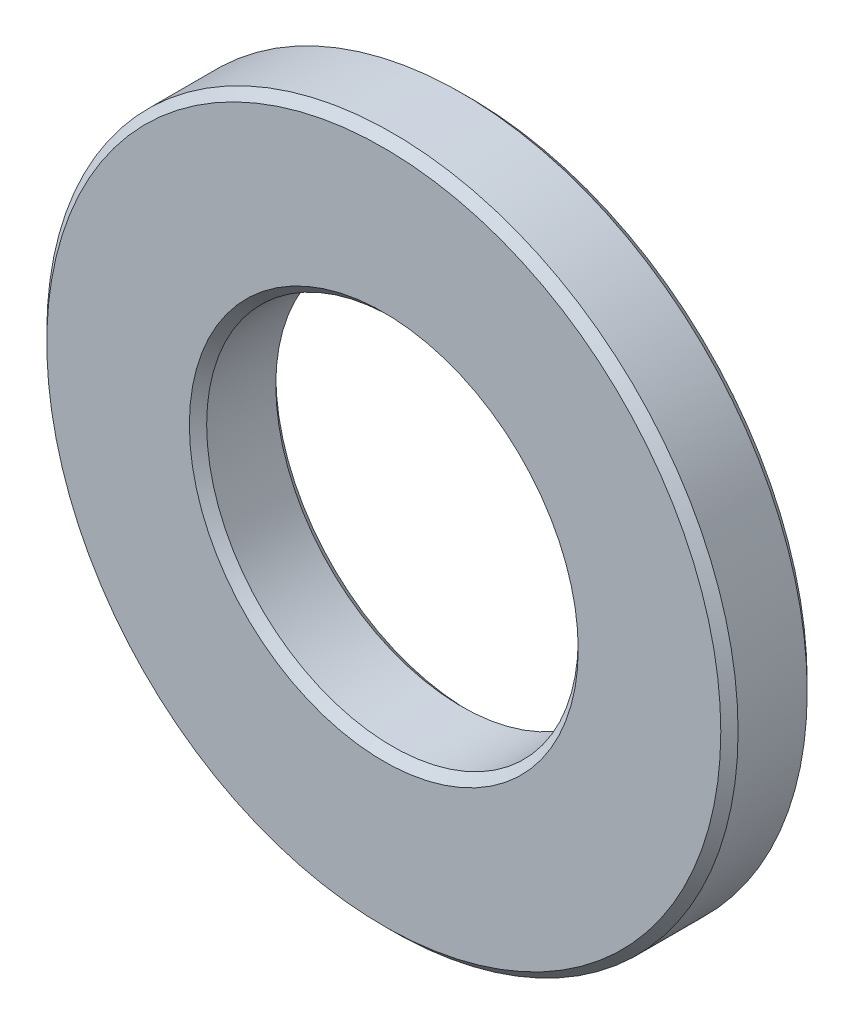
ISO-10303-21;
HEADER;
FILE_DESCRIPTION(('STEP AP214'),'2;1');
FILE_NAME('part.step','',(''),(''),'','','');
FILE_SCHEMA(('AUTOMOTIVE_DESIGN { 1 0 10303 214 1 1 1 1 }'));
ENDSEC;
DATA;
#1=APPLICATION_CONTEXT('core data for automotive mechanical design processes');
#2=APPLICATION_PROTOCOL_DEFINITION('international standard','automotive_design',2000,#1);
#3=PRODUCT_CONTEXT('',#1,'mechanical');
#4=PRODUCT('Part','Part','',(#3));
#5=PRODUCT_RELATED_PRODUCT_CATEGORY('part','',(#4));
#6=PRODUCT_DEFINITION_FORMATION('','',#4);
#7=PRODUCT_DEFINITION_CONTEXT('part definition',#1,'design');
#8=PRODUCT_DEFINITION('design','',#6,#7);
#9=PRODUCT_DEFINITION_SHAPE('','',#8);
#10=(LENGTH_UNIT() NAMED_UNIT(*) SI_UNIT(.MILLI.,.METRE.));
#11=(NAMED_UNIT(*) PLANE_ANGLE_UNIT() SI_UNIT($,.RADIAN.));
#12=(NAMED_UNIT(*) SI_UNIT($,.STERADIAN.) SOLID_ANGLE_UNIT());
#13=UNCERTAINTY_MEASURE_WITH_UNIT(LENGTH_MEASURE(1.E-05),#10,'distance_accuracy_value','');
#14=(GEOMETRIC_REPRESENTATION_CONTEXT(3) GLOBAL_UNCERTAINTY_ASSIGNED_CONTEXT((#13)) GLOBAL_UNIT_ASSIGNED_CONTEXT((#10,
#11,#12)) REPRESENTATION_CONTEXT('',''));
#15=CARTESIAN_POINT('',(0.,0.,0.));
#16=DIRECTION('',(0.,0.,1.));
#17=DIRECTION('',(1.,0.,0.));
#18=AXIS2_PLACEMENT_3D('',#15,#16,#17);
#19=CARTESIAN_POINT('',(0.,0.,0.5));
#20=DIRECTION('',(0.,0.,1.));
#21=DIRECTION('',(1.,0.,0.));
#22=AXIS2_PLACEMENT_3D('',#19,#20,#21);
#23=PLANE('',#22);
#24=CARTESIAN_POINT('',(0.,0.,0.5));
#25=DIRECTION('',(0.,0.,1.));
#26=DIRECTION('',(1.,0.,0.));
#27=AXIS2_PLACEMENT_3D('',#24,#25,#26);
#28=CIRCLE('',#27,2.25);
#29=CARTESIAN_POINT('',(2.25,0.,0.5));
#30=VERTEX_POINT('',#29);
#31=EDGE_CURVE('E10',#30,#30,#28,.F.);
#32=ORIENTED_EDGE('',*,*,#31,.T.);
#33=EDGE_LOOP('',(#32));
#34=FACE_BOUND('',#33,.T.);
#35=CARTESIAN_POINT('',(0.,0.,0.5));
#36=DIRECTION('',(0.,0.,1.));
#37=DIRECTION('',(1.,0.,0.));
#38=AXIS2_PLACEMENT_3D('',#35,#36,#37);
#39=CIRCLE('',#38,3.9);
#40=CARTESIAN_POINT('',(3.9,0.,0.5));
#41=VERTEX_POINT('',#40);
#42=EDGE_CURVE('E45',#41,#41,#39,.T.);
#43=ORIENTED_EDGE('',*,*,#42,.T.);
#44=EDGE_LOOP('',(#43));
#45=FACE_BOUND('',#44,.T.);
#46=ADVANCED_FACE('F37',(#34,#45),#23,.T.);
#47=CARTESIAN_POINT('',(0.,0.,-0.5));
#48=DIRECTION('',(0.,0.,1.));
#49=DIRECTION('',(1.,0.,0.));
#50=AXIS2_PLACEMENT_3D('',#47,#48,#49);
#51=PLANE('',#50);
#52=CARTESIAN_POINT('',(0.,0.,-0.5));
#53=DIRECTION('',(0.,0.,1.));
#54=DIRECTION('',(1.,0.,0.));
#55=AXIS2_PLACEMENT_3D('',#52,#53,#54);
#56=CIRCLE('',#55,3.9);
#57=CARTESIAN_POINT('',(3.9,0.,-0.5));
#58=VERTEX_POINT('',#57);
#59=EDGE_CURVE('E63',#58,#58,#56,.F.);
#60=ORIENTED_EDGE('',*,*,#59,.T.);
#61=EDGE_LOOP('',(#60));
#62=FACE_BOUND('',#61,.T.);
#63=CARTESIAN_POINT('',(0.,0.,-0.5));
#64=DIRECTION('',(0.,0.,1.));
#65=DIRECTION('',(1.,0.,0.));
#66=AXIS2_PLACEMENT_3D('',#63,#64,#65);
#67=CIRCLE('',#66,2.25);
#68=CARTESIAN_POINT('',(-2.25,0.,-0.5));
#69=VERTEX_POINT('',#68);
#70=EDGE_CURVE('E67',#69,#69,#67,.T.);
#71=ORIENTED_EDGE('',*,*,#70,.T.);
#72=EDGE_LOOP('',(#71));
#73=FACE_BOUND('',#72,.T.);
#74=ADVANCED_FACE('F89',(#62,#73),#51,.F.);
#75=CARTESIAN_POINT('',(0.,0.,0.5));
#76=DIRECTION('',(0.,0.,-1.));
#77=DIRECTION('',(-1.,0.,0.));
#78=AXIS2_PLACEMENT_3D('',#75,#76,#77);
#79=CYLINDRICAL_SURFACE('',#78,4.);
#80=CARTESIAN_POINT('',(0.,0.,-0.400000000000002));
#81=DIRECTION('',(0.,0.,1.));
#82=DIRECTION('',(1.,0.,0.));
#83=AXIS2_PLACEMENT_3D('',#80,#81,#82);
#84=CIRCLE('',#83,4.);
#85=CARTESIAN_POINT('',(4.,0.,-0.400000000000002));
#86=VERTEX_POINT('',#85);
#87=EDGE_CURVE('E71',#86,#86,#84,.T.);
#88=ORIENTED_EDGE('',*,*,#87,.T.);
#89=EDGE_LOOP('',(#88));
#90=FACE_BOUND('',#89,.T.);
#91=CARTESIAN_POINT('',(0.,0.,0.400000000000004));
#92=DIRECTION('',(0.,0.,1.));
#93=DIRECTION('',(1.,0.,0.));
#94=AXIS2_PLACEMENT_3D('',#91,#92,#93);
#95=CIRCLE('',#94,4.);
#96=CARTESIAN_POINT('',(4.,0.,0.400000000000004));
#97=VERTEX_POINT('',#96);
#98=EDGE_CURVE('E74',#97,#97,#95,.F.);
#99=ORIENTED_EDGE('',*,*,#98,.T.);
#100=EDGE_LOOP('',(#99));
#101=FACE_BOUND('',#100,.T.);
#102=ADVANCED_FACE('F78',(#90,#101),#79,.T.);
#103=CARTESIAN_POINT('',(0.,0.,0.5));
#104=DIRECTION('',(0.,0.,-1.));
#105=DIRECTION('',(-1.,0.,0.));
#106=AXIS2_PLACEMENT_3D('',#103,#104,#105);
#107=CYLINDRICAL_SURFACE('',#106,2.15);
#108=CARTESIAN_POINT('',(0.,0.,-0.4));
#109=DIRECTION('',(0.,0.,1.));
#110=DIRECTION('',(1.,0.,0.));
#111=AXIS2_PLACEMENT_3D('',#108,#109,#110);
#112=CIRCLE('',#111,2.15);
#113=CARTESIAN_POINT('',(-2.15,0.,-0.4));
#114=VERTEX_POINT('',#113);
#115=EDGE_CURVE('E52',#114,#114,#112,.F.);
#116=CARTESIAN_POINT('',(0.,0.,0.400000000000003));
#117=DIRECTION('',(0.,0.,1.));
#118=DIRECTION('',(1.,0.,0.));
#119=AXIS2_PLACEMENT_3D('',#116,#117,#118);
#120=CIRCLE('',#119,2.15);
#121=CARTESIAN_POINT('',(-2.15,0.,0.400000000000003));
#122=VERTEX_POINT('',#121);
#123=EDGE_CURVE('E57',#122,#122,#120,.T.);
#124=CARTESIAN_POINT('',(-2.15,0.,-0.4));
#125=CARTESIAN_POINT('',(-2.15,0.,-0.391666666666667));
#126=CARTESIAN_POINT('',(-2.15,0.,-0.383333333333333));
#127=CARTESIAN_POINT('',(-2.15,0.,-0.366666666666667));
#128=CARTESIAN_POINT('',(-2.15,0.,-0.358333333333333));
#129=CARTESIAN_POINT('',(-2.15,0.,-0.341666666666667));
#130=CARTESIAN_POINT('',(-2.15,0.,-0.333333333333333));
#131=CARTESIAN_POINT('',(-2.15,0.,-0.316666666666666));
#132=CARTESIAN_POINT('',(-2.15,0.,-0.308333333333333));
#133=CARTESIAN_POINT('',(-2.15,0.,-0.291666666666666));
#134=CARTESIAN_POINT('',(-2.15,0.,-0.283333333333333));
#135=CARTESIAN_POINT('',(-2.15,0.,-0.266666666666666));
#136=CARTESIAN_POINT('',(-2.15,0.,-0.258333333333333));
#137=CARTESIAN_POINT('',(-2.15,0.,-0.241666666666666));
#138=CARTESIAN_POINT('',(-2.15,0.,-0.233333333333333));
#139=CARTESIAN_POINT('',(-2.15,0.,-0.216666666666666));
#140=CARTESIAN_POINT('',(-2.15,0.,-0.208333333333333));
#141=CARTESIAN_POINT('',(-2.15,0.,-0.191666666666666));
#142=CARTESIAN_POINT('',(-2.15,0.,-0.183333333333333));
#143=CARTESIAN_POINT('',(-2.15,0.,-0.166666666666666));
#144=CARTESIAN_POINT('',(-2.15,0.,-0.158333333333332));
#145=CARTESIAN_POINT('',(-2.15,0.,-0.141666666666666));
#146=CARTESIAN_POINT('',(-2.15,0.,-0.133333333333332));
#147=CARTESIAN_POINT('',(-2.15,0.,-0.116666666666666));
#148=CARTESIAN_POINT('',(-2.15,0.,-0.108333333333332));
#149=CARTESIAN_POINT('',(-2.15,0.,-0.0916666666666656));
#150=CARTESIAN_POINT('',(-2.15,0.,-0.0833333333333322));
#151=CARTESIAN_POINT('',(-2.15,0.,-0.0666666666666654));
#152=CARTESIAN_POINT('',(-2.15,0.,-0.0583333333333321));
#153=CARTESIAN_POINT('',(-2.15,0.,-0.0416666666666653));
#154=CARTESIAN_POINT('',(-2.15,0.,-0.0333333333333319));
#155=CARTESIAN_POINT('',(-2.15,0.,-0.0166666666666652));
#156=CARTESIAN_POINT('',(-2.15,0.,-0.00833333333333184));
#157=CARTESIAN_POINT('',(-2.15,0.,0.00833333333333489));
#158=CARTESIAN_POINT('',(-2.15,0.,0.0166666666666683));
#159=CARTESIAN_POINT('',(-2.15,0.,0.033333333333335));
#160=CARTESIAN_POINT('',(-2.15,0.,0.0416666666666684));
#161=CARTESIAN_POINT('',(-2.15,0.,0.0583333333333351));
#162=CARTESIAN_POINT('',(-2.15,0.,0.0666666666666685));
#163=CARTESIAN_POINT('',(-2.15,0.,0.0833333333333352));
#164=CARTESIAN_POINT('',(-2.15,0.,0.0916666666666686));
#165=CARTESIAN_POINT('',(-2.15,0.,0.108333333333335));
#166=CARTESIAN_POINT('',(-2.15,0.,0.116666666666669));
#167=CARTESIAN_POINT('',(-2.15,0.,0.133333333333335));
#168=CARTESIAN_POINT('',(-2.15,0.,0.141666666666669));
#169=CARTESIAN_POINT('',(-2.15,0.,0.158333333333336));
#170=CARTESIAN_POINT('',(-2.15,0.,0.166666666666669));
#171=CARTESIAN_POINT('',(-2.15,0.,0.183333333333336));
#172=CARTESIAN_POINT('',(-2.15,0.,0.191666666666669));
#173=CARTESIAN_POINT('',(-2.15,0.,0.208333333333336));
#174=CARTESIAN_POINT('',(-2.15,0.,0.216666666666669));
#175=CARTESIAN_POINT('',(-2.15,0.,0.233333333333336));
#176=CARTESIAN_POINT('',(-2.15,0.,0.241666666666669));
#177=CARTESIAN_POINT('',(-2.15,0.,0.258333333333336));
#178=CARTESIAN_POINT('',(-2.15,0.,0.266666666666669));
#179=CARTESIAN_POINT('',(-2.15,0.,0.283333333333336));
#180=CARTESIAN_POINT('',(-2.15,0.,0.291666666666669));
#181=CARTESIAN_POINT('',(-2.15,0.,0.308333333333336));
#182=CARTESIAN_POINT('',(-2.15,0.,0.31666666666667));
#183=CARTESIAN_POINT('',(-2.15,0.,0.333333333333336));
#184=CARTESIAN_POINT('',(-2.15,0.,0.34166666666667));
#185=CARTESIAN_POINT('',(-2.15,0.,0.358333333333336));
#186=CARTESIAN_POINT('',(-2.15,0.,0.36666666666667));
#187=CARTESIAN_POINT('',(-2.15,0.,0.383333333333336));
#188=CARTESIAN_POINT('',(-2.15,0.,0.39166666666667));
#189=CARTESIAN_POINT('',(-2.15,0.,0.400000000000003));
#190=B_SPLINE_CURVE_WITH_KNOTS('',3,(#124,#125,#126,#127,#128,#129,#130,#131,#132,#133,#134,
#135,#136,#137,#138,#139,#140,#141,#142,#143,#144,#145,#146,#147,#148,#149,#150,#151,#152,#153,
#154,#155,#156,#157,#158,#159,#160,#161,#162,#163,#164,#165,#166,#167,#168,#169,#170,#171,#172,
#173,#174,#175,#176,#177,#178,#179,#180,#181,#182,#183,#184,#185,#186,#187,#188,#189),
.UNSPECIFIED.,.F.,.F.,(4,2,2,2,2,2,2,2,2,2,2,2,2,2,2,2,2,2,2,2,2,2,2,2,2,2,2,2,2,2,2,2,4),(0.,
0.0250000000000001,0.0500000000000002,0.0750000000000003,0.1,0.125000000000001,
0.150000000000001,0.175000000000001,0.200000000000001,0.225000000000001,0.250000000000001,
0.275000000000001,0.300000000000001,0.325000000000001,0.350000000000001,0.375000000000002,
0.400000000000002,0.425000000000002,0.450000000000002,0.475000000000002,0.500000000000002,
0.525000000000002,0.550000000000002,0.575000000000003,0.600000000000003,0.625000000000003,
0.650000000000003,0.675000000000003,0.700000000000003,0.725000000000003,0.750000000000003,
0.775000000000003,0.800000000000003),.UNSPECIFIED.);
#191=EDGE_CURVE('BSEAM97',#114,#122,#190,.T.);
#192=ORIENTED_EDGE('',*,*,#115,.T.);
#193=ORIENTED_EDGE('',*,*,#123,.T.);
#194=ORIENTED_EDGE('',*,*,#191,.T.);
#195=ORIENTED_EDGE('',*,*,#191,.F.);
#196=EDGE_LOOP('',(#192,#194,#193,#195));
#197=FACE_BOUND('',#196,.T.);
#198=ADVANCED_FACE('F97',(#197),#107,.F.);
#199=CARTESIAN_POINT('',(0.,0.,-0.400000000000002));
#200=DIRECTION('',(0.,0.,1.));
#201=DIRECTION('',(1.,0.,0.));
#202=AXIS2_PLACEMENT_3D('',#199,#200,#201);
#203=CONICAL_SURFACE('',#202,4.,0.785398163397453);
#204=ORIENTED_EDGE('',*,*,#59,.F.);
#205=EDGE_LOOP('',(#204));
#206=FACE_BOUND('',#205,.T.);
#207=ORIENTED_EDGE('',*,*,#87,.F.);
#208=EDGE_LOOP('',(#207));
#209=FACE_BOUND('',#208,.T.);
#210=ADVANCED_FACE('F102',(#206,#209),#203,.T.);
#211=CARTESIAN_POINT('',(0.,0.,-0.5));
#212=DIRECTION('',(0.,0.,-1.));
#213=DIRECTION('',(-1.,0.,0.));
#214=AXIS2_PLACEMENT_3D('',#211,#212,#213);
#215=CONICAL_SURFACE('',#214,2.25,0.785398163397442);
#216=CARTESIAN_POINT('',(-2.15,0.,-0.4));
#217=CARTESIAN_POINT('',(-2.15104166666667,0.,-0.401041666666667));
#218=CARTESIAN_POINT('',(-2.15208333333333,0.,-0.402083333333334));
#219=CARTESIAN_POINT('',(-2.15416666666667,0.,-0.404166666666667));
#220=CARTESIAN_POINT('',(-2.15520833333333,0.,-0.405208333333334));
#221=CARTESIAN_POINT('',(-2.15729166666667,0.,-0.407291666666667));
#222=CARTESIAN_POINT('',(-2.15833333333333,0.,-0.408333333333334));
#223=CARTESIAN_POINT('',(-2.16041666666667,0.,-0.410416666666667));
#224=CARTESIAN_POINT('',(-2.16145833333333,0.,-0.411458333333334));
#225=CARTESIAN_POINT('',(-2.16354166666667,0.,-0.413541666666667));
#226=CARTESIAN_POINT('',(-2.16458333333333,0.,-0.414583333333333));
#227=CARTESIAN_POINT('',(-2.16666666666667,0.,-0.416666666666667));
#228=CARTESIAN_POINT('',(-2.16770833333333,0.,-0.417708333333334));
#229=CARTESIAN_POINT('',(-2.16979166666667,0.,-0.419791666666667));
#230=CARTESIAN_POINT('',(-2.17083333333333,0.,-0.420833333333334));
#231=CARTESIAN_POINT('',(-2.17291666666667,0.,-0.422916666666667));
#232=CARTESIAN_POINT('',(-2.17395833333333,0.,-0.423958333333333));
#233=CARTESIAN_POINT('',(-2.17604166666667,0.,-0.426041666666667));
#234=CARTESIAN_POINT('',(-2.17708333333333,0.,-0.427083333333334));
#235=CARTESIAN_POINT('',(-2.17916666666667,0.,-0.429166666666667));
#236=CARTESIAN_POINT('',(-2.18020833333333,0.,-0.430208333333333));
#237=CARTESIAN_POINT('',(-2.18229166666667,0.,-0.432291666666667));
#238=CARTESIAN_POINT('',(-2.18333333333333,0.,-0.433333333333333));
#239=CARTESIAN_POINT('',(-2.18541666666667,0.,-0.435416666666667));
#240=CARTESIAN_POINT('',(-2.18645833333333,0.,-0.436458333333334));
#241=CARTESIAN_POINT('',(-2.18854166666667,0.,-0.438541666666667));
#242=CARTESIAN_POINT('',(-2.18958333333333,0.,-0.439583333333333));
#243=CARTESIAN_POINT('',(-2.19166666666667,0.,-0.441666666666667));
#244=CARTESIAN_POINT('',(-2.19270833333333,0.,-0.442708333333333));
#245=CARTESIAN_POINT('',(-2.19479166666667,0.,-0.444791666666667));
#246=CARTESIAN_POINT('',(-2.19583333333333,0.,-0.445833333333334));
#247=CARTESIAN_POINT('',(-2.19791666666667,0.,-0.447916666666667));
#248=CARTESIAN_POINT('',(-2.19895833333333,0.,-0.448958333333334));
#249=CARTESIAN_POINT('',(-2.20104166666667,0.,-0.451041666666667));
#250=CARTESIAN_POINT('',(-2.20208333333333,0.,-0.452083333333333));
#251=CARTESIAN_POINT('',(-2.20416666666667,0.,-0.454166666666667));
#252=CARTESIAN_POINT('',(-2.20520833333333,0.,-0.455208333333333));
#253=CARTESIAN_POINT('',(-2.20729166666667,0.,-0.457291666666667));
#254=CARTESIAN_POINT('',(-2.20833333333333,0.,-0.458333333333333));
#255=CARTESIAN_POINT('',(-2.21041666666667,0.,-0.460416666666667));
#256=CARTESIAN_POINT('',(-2.21145833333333,0.,-0.461458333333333));
#257=CARTESIAN_POINT('',(-2.21354166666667,0.,-0.463541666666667));
#258=CARTESIAN_POINT('',(-2.21458333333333,0.,-0.464583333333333));
#259=CARTESIAN_POINT('',(-2.21666666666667,0.,-0.466666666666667));
#260=CARTESIAN_POINT('',(-2.21770833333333,0.,-0.467708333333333));
#261=CARTESIAN_POINT('',(-2.21979166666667,0.,-0.469791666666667));
#262=CARTESIAN_POINT('',(-2.22083333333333,0.,-0.470833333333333));
#263=CARTESIAN_POINT('',(-2.22291666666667,0.,-0.472916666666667));
#264=CARTESIAN_POINT('',(-2.22395833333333,0.,-0.473958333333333));
#265=CARTESIAN_POINT('',(-2.22604166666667,0.,-0.476041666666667));
#266=CARTESIAN_POINT('',(-2.22708333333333,0.,-0.477083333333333));
#267=CARTESIAN_POINT('',(-2.22916666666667,0.,-0.479166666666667));
#268=CARTESIAN_POINT('',(-2.23020833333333,0.,-0.480208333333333));
#269=CARTESIAN_POINT('',(-2.23229166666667,0.,-0.482291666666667));
#270=CARTESIAN_POINT('',(-2.23333333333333,0.,-0.483333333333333));
#271=CARTESIAN_POINT('',(-2.23541666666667,0.,-0.485416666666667));
#272=CARTESIAN_POINT('',(-2.23645833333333,0.,-0.486458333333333));
#273=CARTESIAN_POINT('',(-2.23854166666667,0.,-0.488541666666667));
#274=CARTESIAN_POINT('',(-2.23958333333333,0.,-0.489583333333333));
#275=CARTESIAN_POINT('',(-2.24166666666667,0.,-0.491666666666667));
#276=CARTESIAN_POINT('',(-2.24270833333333,0.,-0.492708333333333));
#277=CARTESIAN_POINT('',(-2.24479166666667,0.,-0.494791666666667));
#278=CARTESIAN_POINT('',(-2.24583333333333,0.,-0.495833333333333));
#279=CARTESIAN_POINT('',(-2.24791666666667,0.,-0.497916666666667));
#280=CARTESIAN_POINT('',(-2.24895833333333,0.,-0.498958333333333));
#281=CARTESIAN_POINT('',(-2.25,0.,-0.5));
#282=B_SPLINE_CURVE_WITH_KNOTS('',3,(#216,#217,#218,#219,#220,#221,#222,#223,#224,#225,#226,
#227,#228,#229,#230,#231,#232,#233,#234,#235,#236,#237,#238,#239,#240,#241,#242,#243,#244,#245,
#246,#247,#248,#249,#250,#251,#252,#253,#254,#255,#256,#257,#258,#259,#260,#261,#262,#263,#264,
#265,#266,#267,#268,#269,#270,#271,#272,#273,#274,#275,#276,#277,#278,#279,#280,#281),
.UNSPECIFIED.,.F.,.F.,(4,2,2,2,2,2,2,2,2,2,2,2,2,2,2,2,2,2,2,2,2,2,2,2,2,2,2,2,2,2,2,2,4),(0.,
0.00441941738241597,0.00883883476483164,0.0132582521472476,0.0176776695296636,
0.0220970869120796,0.0265165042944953,0.0309359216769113,0.0353553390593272,0.0397747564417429,
0.0441941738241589,0.0486135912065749,0.0530330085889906,0.0574524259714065,0.0618718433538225,
0.0662912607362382,0.0707106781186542,0.0751300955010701,0.0795495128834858,0.0839689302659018,
0.0883883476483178,0.0928077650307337,0.0972271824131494,0.101646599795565,0.106066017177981,
0.110485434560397,0.114904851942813,0.119324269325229,0.123743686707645,0.128163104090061,
0.132582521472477,0.137001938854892,0.141421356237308),.UNSPECIFIED.);
#283=EDGE_CURVE('BSEAM86',#114,#69,#282,.T.);
#284=ORIENTED_EDGE('',*,*,#115,.F.);
#285=ORIENTED_EDGE('',*,*,#70,.F.);
#286=ORIENTED_EDGE('',*,*,#283,.T.);
#287=ORIENTED_EDGE('',*,*,#283,.F.);
#288=EDGE_LOOP('',(#284,#286,#285,#287));
#289=FACE_BOUND('',#288,.T.);
#290=ADVANCED_FACE('F86',(#289),#215,.F.);
#291=CARTESIAN_POINT('',(0.,0.,0.400000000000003));
#292=DIRECTION('',(0.,0.,1.));
#293=DIRECTION('',(1.,0.,0.));
#294=AXIS2_PLACEMENT_3D('',#291,#292,#293);
#295=CONICAL_SURFACE('',#294,2.15,0.785398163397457);
#296=ORIENTED_EDGE('',*,*,#31,.F.);
#297=EDGE_LOOP('',(#296));
#298=FACE_BOUND('',#297,.T.);
#299=ORIENTED_EDGE('',*,*,#123,.F.);
#300=EDGE_LOOP('',(#299));
#301=FACE_BOUND('',#300,.T.);
#302=ADVANCED_FACE('F82',(#298,#301),#295,.F.);
#303=CARTESIAN_POINT('',(0.,0.,0.5));
#304=DIRECTION('',(0.,0.,-1.));
#305=DIRECTION('',(-1.,0.,0.));
#306=AXIS2_PLACEMENT_3D('',#303,#304,#305);
#307=CONICAL_SURFACE('',#306,3.9,0.785398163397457);
#308=ORIENTED_EDGE('',*,*,#98,.F.);
#309=EDGE_LOOP('',(#308));
#310=FACE_BOUND('',#309,.T.);
#311=ORIENTED_EDGE('',*,*,#42,.F.);
#312=EDGE_LOOP('',(#311));
#313=FACE_BOUND('',#312,.T.);
#314=ADVANCED_FACE('F39',(#310,#313),#307,.T.);
#315=CLOSED_SHELL('',(#46,#74,#102,#198,#210,#290,#302,#314));
#316=MANIFOLD_SOLID_BREP('B2',#315);
#317=ADVANCED_BREP_SHAPE_REPRESENTATION('',(#18,#316),#14);
#318=SHAPE_DEFINITION_REPRESENTATION(#9,#317);
ENDSEC;
END-ISO-10303-21;
